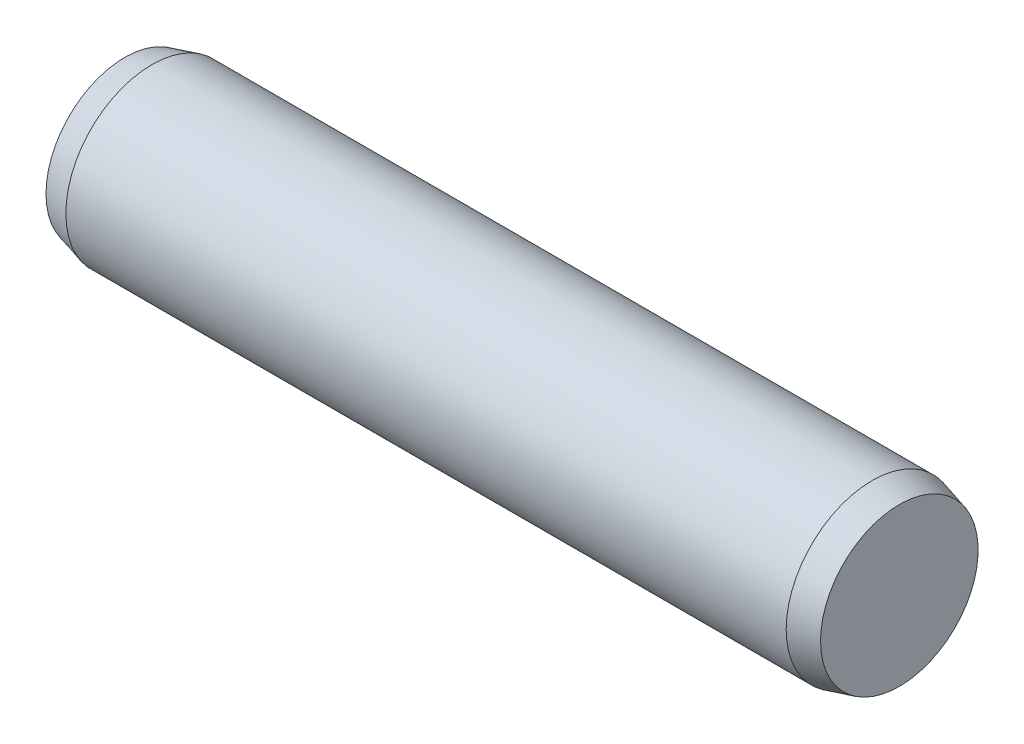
from build123d import *


with BuildPart() as part:
    # Sketch1 → Base-Revolve (revolve)
    with BuildSketch(Plane.XY, mode=Mode.PRIVATE) as base_revolve_sk:
        Polygon((0, 0), (18, 0), (18, 1.831192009), (17.37, 2), (0.63, 2), (0, 1.831192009), align=None)
    revolve(base_revolve_sk.sketch.rotate(Axis((-6.35, 0, 0), (1, 0, 0)), 90), axis=Axis((-6.35, 0, 0), (1, 0, 0)))


solid = part.part
